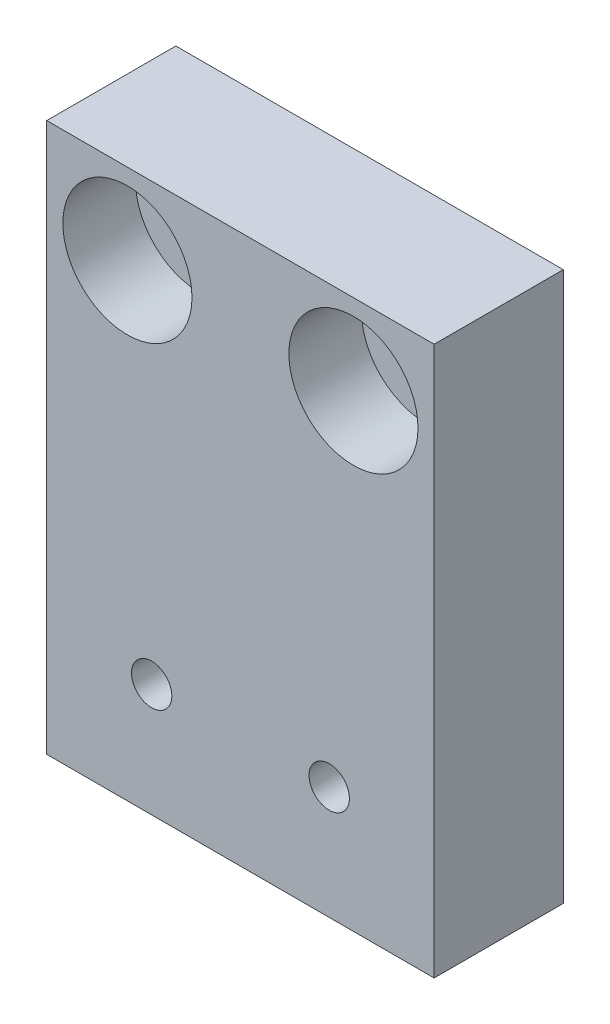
ISO-10303-21;
HEADER;
FILE_DESCRIPTION(('STEP AP214'),'2;1');
FILE_NAME('part.step','',(''),(''),'','','');
FILE_SCHEMA(('AUTOMOTIVE_DESIGN { 1 0 10303 214 1 1 1 1 }'));
ENDSEC;
DATA;
#1=APPLICATION_CONTEXT('core data for automotive mechanical design processes');
#2=APPLICATION_PROTOCOL_DEFINITION('international standard','automotive_design',2000,#1);
#3=PRODUCT_CONTEXT('',#1,'mechanical');
#4=PRODUCT('Part','Part','',(#3));
#5=PRODUCT_RELATED_PRODUCT_CATEGORY('part','',(#4));
#6=PRODUCT_DEFINITION_FORMATION('','',#4);
#7=PRODUCT_DEFINITION_CONTEXT('part definition',#1,'design');
#8=PRODUCT_DEFINITION('design','',#6,#7);
#9=PRODUCT_DEFINITION_SHAPE('','',#8);
#10=(LENGTH_UNIT() NAMED_UNIT(*) SI_UNIT(.MILLI.,.METRE.));
#11=(NAMED_UNIT(*) PLANE_ANGLE_UNIT() SI_UNIT($,.RADIAN.));
#12=(NAMED_UNIT(*) SI_UNIT($,.STERADIAN.) SOLID_ANGLE_UNIT());
#13=UNCERTAINTY_MEASURE_WITH_UNIT(LENGTH_MEASURE(1.E-05),#10,'distance_accuracy_value','');
#14=(GEOMETRIC_REPRESENTATION_CONTEXT(3) GLOBAL_UNCERTAINTY_ASSIGNED_CONTEXT((#13)) GLOBAL_UNIT_ASSIGNED_CONTEXT((#10,
#11,#12)) REPRESENTATION_CONTEXT('',''));
#15=CARTESIAN_POINT('',(0.,0.,0.));
#16=DIRECTION('',(0.,0.,1.));
#17=DIRECTION('',(1.,0.,0.));
#18=AXIS2_PLACEMENT_3D('',#15,#16,#17);
#19=CARTESIAN_POINT('',(19.,29.,-4.5));
#20=DIRECTION('',(0.,0.,1.));
#21=DIRECTION('',(1.,0.,0.));
#22=AXIS2_PLACEMENT_3D('',#19,#20,#21);
#23=CYLINDRICAL_SURFACE('',#22,4.);
#24=CARTESIAN_POINT('',(19.,29.,-4.5));
#25=DIRECTION('',(0.,0.,1.));
#26=DIRECTION('',(1.,0.,0.));
#27=AXIS2_PLACEMENT_3D('',#24,#25,#26);
#28=CIRCLE('',#27,4.);
#29=CARTESIAN_POINT('',(23.,29.,-4.5));
#30=VERTEX_POINT('',#29);
#31=EDGE_CURVE('E20',#30,#30,#28,.T.);
#32=ORIENTED_EDGE('',*,*,#31,.F.);
#33=EDGE_LOOP('',(#32));
#34=FACE_BOUND('',#33,.T.);
#35=CARTESIAN_POINT('',(19.,29.,0.));
#36=DIRECTION('',(0.,0.,1.));
#37=DIRECTION('',(1.,0.,0.));
#38=AXIS2_PLACEMENT_3D('',#35,#36,#37);
#39=CIRCLE('',#38,4.);
#40=CARTESIAN_POINT('',(23.,29.,0.));
#41=VERTEX_POINT('',#40);
#42=EDGE_CURVE('E108',#41,#41,#39,.T.);
#43=ORIENTED_EDGE('',*,*,#42,.T.);
#44=EDGE_LOOP('',(#43));
#45=FACE_BOUND('',#44,.T.);
#46=ADVANCED_FACE('F17',(#34,#45),#23,.F.);
#47=CARTESIAN_POINT('',(5.,29.,-4.5));
#48=DIRECTION('',(0.,0.,1.));
#49=DIRECTION('',(1.,0.,0.));
#50=AXIS2_PLACEMENT_3D('',#47,#48,#49);
#51=CYLINDRICAL_SURFACE('',#50,4.);
#52=CARTESIAN_POINT('',(5.,29.,-4.5));
#53=DIRECTION('',(0.,0.,1.));
#54=DIRECTION('',(1.,0.,0.));
#55=AXIS2_PLACEMENT_3D('',#52,#53,#54);
#56=CIRCLE('',#55,4.);
#57=CARTESIAN_POINT('',(9.,29.,-4.5));
#58=VERTEX_POINT('',#57);
#59=EDGE_CURVE('E110',#58,#58,#56,.T.);
#60=ORIENTED_EDGE('',*,*,#59,.F.);
#61=EDGE_LOOP('',(#60));
#62=FACE_BOUND('',#61,.T.);
#63=CARTESIAN_POINT('',(5.,29.,0.));
#64=DIRECTION('',(0.,0.,1.));
#65=DIRECTION('',(1.,0.,0.));
#66=AXIS2_PLACEMENT_3D('',#63,#64,#65);
#67=CIRCLE('',#66,4.);
#68=CARTESIAN_POINT('',(9.,29.,0.));
#69=VERTEX_POINT('',#68);
#70=EDGE_CURVE('E105',#69,#69,#67,.T.);
#71=ORIENTED_EDGE('',*,*,#70,.T.);
#72=EDGE_LOOP('',(#71));
#73=FACE_BOUND('',#72,.T.);
#74=ADVANCED_FACE('F121',(#62,#73),#51,.F.);
#75=CARTESIAN_POINT('',(19.,29.,-4.5));
#76=DIRECTION('',(0.,0.,1.));
#77=DIRECTION('',(1.,0.,0.));
#78=AXIS2_PLACEMENT_3D('',#75,#76,#77);
#79=PLANE('',#78);
#80=CARTESIAN_POINT('',(19.,29.,-4.5));
#81=DIRECTION('',(0.,0.,1.));
#82=DIRECTION('',(1.,0.,0.));
#83=AXIS2_PLACEMENT_3D('',#80,#81,#82);
#84=CIRCLE('',#83,2.25);
#85=CARTESIAN_POINT('',(21.25,29.,-4.5));
#86=VERTEX_POINT('',#85);
#87=EDGE_CURVE('E96',#86,#86,#84,.F.);
#88=ORIENTED_EDGE('',*,*,#87,.T.);
#89=EDGE_LOOP('',(#88));
#90=FACE_BOUND('',#89,.T.);
#91=ORIENTED_EDGE('',*,*,#31,.T.);
#92=EDGE_LOOP('',(#91));
#93=FACE_BOUND('',#92,.T.);
#94=ADVANCED_FACE('F117',(#90,#93),#79,.T.);
#95=CARTESIAN_POINT('',(5.,29.,-4.5));
#96=DIRECTION('',(0.,0.,1.));
#97=DIRECTION('',(1.,0.,0.));
#98=AXIS2_PLACEMENT_3D('',#95,#96,#97);
#99=PLANE('',#98);
#100=CARTESIAN_POINT('',(5.,29.,-4.5));
#101=DIRECTION('',(0.,0.,1.));
#102=DIRECTION('',(1.,0.,0.));
#103=AXIS2_PLACEMENT_3D('',#100,#101,#102);
#104=CIRCLE('',#103,2.25);
#105=CARTESIAN_POINT('',(7.25,29.,-4.5));
#106=VERTEX_POINT('',#105);
#107=EDGE_CURVE('E67',#106,#106,#104,.F.);
#108=ORIENTED_EDGE('',*,*,#107,.T.);
#109=EDGE_LOOP('',(#108));
#110=FACE_BOUND('',#109,.T.);
#111=ORIENTED_EDGE('',*,*,#59,.T.);
#112=EDGE_LOOP('',(#111));
#113=FACE_BOUND('',#112,.T.);
#114=ADVANCED_FACE('F127',(#110,#113),#99,.T.);
#115=CARTESIAN_POINT('',(0.,34.,0.));
#116=DIRECTION('',(0.,0.,-1.));
#117=DIRECTION('',(-1.,0.,0.));
#118=AXIS2_PLACEMENT_3D('',#115,#116,#117);
#119=PLANE('',#118);
#120=DIRECTION('',(0.,1.,0.));
#121=VECTOR('',#120,1.);
#122=CARTESIAN_POINT('',(24.,34.,0.));
#123=LINE('',#122,#121);
#124=CARTESIAN_POINT('',(24.,0.,0.));
#125=VERTEX_POINT('',#124);
#126=CARTESIAN_POINT('',(24.,34.,0.));
#127=VERTEX_POINT('',#126);
#128=EDGE_CURVE('E58',#125,#127,#123,.T.);
#129=ORIENTED_EDGE('',*,*,#128,.T.);
#130=DIRECTION('',(1.,0.,0.));
#131=VECTOR('',#130,1.);
#132=CARTESIAN_POINT('',(0.,34.,0.));
#133=LINE('',#132,#131);
#134=CARTESIAN_POINT('',(0.,34.,0.));
#135=VERTEX_POINT('',#134);
#136=EDGE_CURVE('E55',#127,#135,#133,.F.);
#137=ORIENTED_EDGE('',*,*,#136,.T.);
#138=DIRECTION('',(0.,1.,0.));
#139=VECTOR('',#138,1.);
#140=CARTESIAN_POINT('',(0.,34.,0.));
#141=LINE('',#140,#139);
#142=CARTESIAN_POINT('',(0.,0.,0.));
#143=VERTEX_POINT('',#142);
#144=EDGE_CURVE('E310',#135,#143,#141,.F.);
#145=ORIENTED_EDGE('',*,*,#144,.T.);
#146=DIRECTION('',(1.,0.,0.));
#147=VECTOR('',#146,1.);
#148=CARTESIAN_POINT('',(0.,0.,0.));
#149=LINE('',#148,#147);
#150=EDGE_CURVE('E61',#125,#143,#149,.F.);
#151=ORIENTED_EDGE('',*,*,#150,.F.);
#152=EDGE_LOOP('',(#129,#137,#145,#151));
#153=FACE_BOUND('',#152,.T.);
#154=ORIENTED_EDGE('',*,*,#70,.F.);
#155=EDGE_LOOP('',(#154));
#156=FACE_BOUND('',#155,.T.);
#157=ORIENTED_EDGE('',*,*,#42,.F.);
#158=EDGE_LOOP('',(#157));
#159=FACE_BOUND('',#158,.T.);
#160=CARTESIAN_POINT('',(17.5,7.,0.));
#161=DIRECTION('',(0.,0.,1.));
#162=DIRECTION('',(1.,0.,0.));
#163=AXIS2_PLACEMENT_3D('',#160,#161,#162);
#164=CIRCLE('',#163,1.24999999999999);
#165=CARTESIAN_POINT('',(18.75,7.,0.));
#166=VERTEX_POINT('',#165);
#167=EDGE_CURVE('E99',#166,#166,#164,.F.);
#168=ORIENTED_EDGE('',*,*,#167,.T.);
#169=EDGE_LOOP('',(#168));
#170=FACE_BOUND('',#169,.T.);
#171=CARTESIAN_POINT('',(6.5,7.,0.));
#172=DIRECTION('',(0.,0.,1.));
#173=DIRECTION('',(1.,0.,0.));
#174=AXIS2_PLACEMENT_3D('',#171,#172,#173);
#175=CIRCLE('',#174,1.24999999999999);
#176=CARTESIAN_POINT('',(7.74999999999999,7.,0.));
#177=VERTEX_POINT('',#176);
#178=EDGE_CURVE('E102',#177,#177,#175,.F.);
#179=ORIENTED_EDGE('',*,*,#178,.T.);
#180=EDGE_LOOP('',(#179));
#181=FACE_BOUND('',#180,.T.);
#182=ADVANCED_FACE('F59',(#153,#156,#159,#170,#181),#119,.F.);
#183=CARTESIAN_POINT('',(6.5,7.,0.));
#184=DIRECTION('',(0.,0.,1.));
#185=DIRECTION('',(1.,0.,0.));
#186=AXIS2_PLACEMENT_3D('',#183,#184,#185);
#187=CYLINDRICAL_SURFACE('',#186,1.24999999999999);
#188=CARTESIAN_POINT('',(6.5,7.,-8.));
#189=DIRECTION('',(0.,0.,1.));
#190=DIRECTION('',(1.,0.,0.));
#191=AXIS2_PLACEMENT_3D('',#188,#189,#190);
#192=CIRCLE('',#191,1.24999999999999);
#193=CARTESIAN_POINT('',(7.74999999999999,7.,-8.));
#194=VERTEX_POINT('',#193);
#195=EDGE_CURVE('E91',#194,#194,#192,.F.);
#196=ORIENTED_EDGE('',*,*,#195,.T.);
#197=EDGE_LOOP('',(#196));
#198=FACE_BOUND('',#197,.T.);
#199=ORIENTED_EDGE('',*,*,#178,.F.);
#200=EDGE_LOOP('',(#199));
#201=FACE_BOUND('',#200,.T.);
#202=ADVANCED_FACE('F126',(#198,#201),#187,.F.);
#203=CARTESIAN_POINT('',(17.5,7.,0.));
#204=DIRECTION('',(0.,0.,1.));
#205=DIRECTION('',(1.,0.,0.));
#206=AXIS2_PLACEMENT_3D('',#203,#204,#205);
#207=CYLINDRICAL_SURFACE('',#206,1.24999999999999);
#208=CARTESIAN_POINT('',(17.5,7.,-8.));
#209=DIRECTION('',(0.,0.,1.));
#210=DIRECTION('',(1.,0.,0.));
#211=AXIS2_PLACEMENT_3D('',#208,#209,#210);
#212=CIRCLE('',#211,1.24999999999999);
#213=CARTESIAN_POINT('',(18.75,7.,-8.));
#214=VERTEX_POINT('',#213);
#215=EDGE_CURVE('E88',#214,#214,#212,.F.);
#216=ORIENTED_EDGE('',*,*,#215,.T.);
#217=EDGE_LOOP('',(#216));
#218=FACE_BOUND('',#217,.T.);
#219=ORIENTED_EDGE('',*,*,#167,.F.);
#220=EDGE_LOOP('',(#219));
#221=FACE_BOUND('',#220,.T.);
#222=ADVANCED_FACE('F134',(#218,#221),#207,.F.);
#223=CARTESIAN_POINT('',(19.,29.,-8.));
#224=DIRECTION('',(0.,0.,1.));
#225=DIRECTION('',(1.,0.,0.));
#226=AXIS2_PLACEMENT_3D('',#223,#224,#225);
#227=CYLINDRICAL_SURFACE('',#226,2.25);
#228=CARTESIAN_POINT('',(19.,29.,-8.));
#229=DIRECTION('',(0.,0.,1.));
#230=DIRECTION('',(1.,0.,0.));
#231=AXIS2_PLACEMENT_3D('',#228,#229,#230);
#232=CIRCLE('',#231,2.25);
#233=CARTESIAN_POINT('',(21.25,29.,-8.));
#234=VERTEX_POINT('',#233);
#235=EDGE_CURVE('E85',#234,#234,#232,.F.);
#236=ORIENTED_EDGE('',*,*,#235,.T.);
#237=EDGE_LOOP('',(#236));
#238=FACE_BOUND('',#237,.T.);
#239=ORIENTED_EDGE('',*,*,#87,.F.);
#240=EDGE_LOOP('',(#239));
#241=FACE_BOUND('',#240,.T.);
#242=ADVANCED_FACE('F141',(#238,#241),#227,.F.);
#243=CARTESIAN_POINT('',(5.,29.,-8.));
#244=DIRECTION('',(0.,0.,1.));
#245=DIRECTION('',(1.,0.,0.));
#246=AXIS2_PLACEMENT_3D('',#243,#244,#245);
#247=CYLINDRICAL_SURFACE('',#246,2.25);
#248=CARTESIAN_POINT('',(5.,29.,-8.));
#249=DIRECTION('',(0.,0.,1.));
#250=DIRECTION('',(1.,0.,0.));
#251=AXIS2_PLACEMENT_3D('',#248,#249,#250);
#252=CIRCLE('',#251,2.25);
#253=CARTESIAN_POINT('',(7.25,29.,-8.));
#254=VERTEX_POINT('',#253);
#255=EDGE_CURVE('E82',#254,#254,#252,.F.);
#256=ORIENTED_EDGE('',*,*,#255,.T.);
#257=EDGE_LOOP('',(#256));
#258=FACE_BOUND('',#257,.T.);
#259=ORIENTED_EDGE('',*,*,#107,.F.);
#260=EDGE_LOOP('',(#259));
#261=FACE_BOUND('',#260,.T.);
#262=ADVANCED_FACE('F164',(#258,#261),#247,.F.);
#263=CARTESIAN_POINT('',(24.,34.,0.));
#264=DIRECTION('',(-1.,0.,0.));
#265=DIRECTION('',(0.,0.,1.));
#266=AXIS2_PLACEMENT_3D('',#263,#264,#265);
#267=PLANE('',#266);
#268=DIRECTION('',(0.,1.,0.));
#269=VECTOR('',#268,1.);
#270=CARTESIAN_POINT('',(24.,34.,-8.));
#271=LINE('',#270,#269);
#272=CARTESIAN_POINT('',(24.,0.,-8.));
#273=VERTEX_POINT('',#272);
#274=CARTESIAN_POINT('',(24.,34.,-8.));
#275=VERTEX_POINT('',#274);
#276=EDGE_CURVE('E78',#273,#275,#271,.T.);
#277=ORIENTED_EDGE('',*,*,#276,.T.);
#278=DIRECTION('',(0.,0.,-1.));
#279=VECTOR('',#278,1.);
#280=CARTESIAN_POINT('',(24.,34.,0.));
#281=LINE('',#280,#279);
#282=EDGE_CURVE('E66',#275,#127,#281,.F.);
#283=ORIENTED_EDGE('',*,*,#282,.T.);
#284=ORIENTED_EDGE('',*,*,#128,.F.);
#285=DIRECTION('',(0.,0.,-1.));
#286=VECTOR('',#285,1.);
#287=CARTESIAN_POINT('',(24.,0.,0.));
#288=LINE('',#287,#286);
#289=EDGE_CURVE('E313',#273,#125,#288,.F.);
#290=ORIENTED_EDGE('',*,*,#289,.F.);
#291=EDGE_LOOP('',(#277,#283,#284,#290));
#292=FACE_BOUND('',#291,.T.);
#293=ADVANCED_FACE('F77',(#292),#267,.F.);
#294=CARTESIAN_POINT('',(0.,34.,0.));
#295=DIRECTION('',(0.,-1.,0.));
#296=DIRECTION('',(0.,0.,-1.));
#297=AXIS2_PLACEMENT_3D('',#294,#295,#296);
#298=PLANE('',#297);
#299=ORIENTED_EDGE('',*,*,#136,.F.);
#300=ORIENTED_EDGE('',*,*,#282,.F.);
#301=DIRECTION('',(1.,0.,0.));
#302=VECTOR('',#301,1.);
#303=CARTESIAN_POINT('',(0.,34.,-8.));
#304=LINE('',#303,#302);
#305=CARTESIAN_POINT('',(0.,34.,-8.));
#306=VERTEX_POINT('',#305);
#307=EDGE_CURVE('E319',#275,#306,#304,.F.);
#308=ORIENTED_EDGE('',*,*,#307,.T.);
#309=DIRECTION('',(0.,0.,-1.));
#310=VECTOR('',#309,1.);
#311=CARTESIAN_POINT('',(0.,34.,0.));
#312=LINE('',#311,#310);
#313=EDGE_CURVE('E74',#306,#135,#312,.F.);
#314=ORIENTED_EDGE('',*,*,#313,.T.);
#315=EDGE_LOOP('',(#299,#300,#308,#314));
#316=FACE_BOUND('',#315,.T.);
#317=ADVANCED_FACE('F71',(#316),#298,.F.);
#318=CARTESIAN_POINT('',(0.,34.,0.));
#319=DIRECTION('',(1.,0.,0.));
#320=DIRECTION('',(0.,0.,-1.));
#321=AXIS2_PLACEMENT_3D('',#318,#319,#320);
#322=PLANE('',#321);
#323=ORIENTED_EDGE('',*,*,#144,.F.);
#324=ORIENTED_EDGE('',*,*,#313,.F.);
#325=DIRECTION('',(0.,1.,0.));
#326=VECTOR('',#325,1.);
#327=CARTESIAN_POINT('',(0.,34.,-8.));
#328=LINE('',#327,#326);
#329=CARTESIAN_POINT('',(0.,0.,-8.));
#330=VERTEX_POINT('',#329);
#331=EDGE_CURVE('E26',#306,#330,#328,.F.);
#332=ORIENTED_EDGE('',*,*,#331,.T.);
#333=DIRECTION('',(0.,0.,-1.));
#334=VECTOR('',#333,1.);
#335=CARTESIAN_POINT('',(0.,0.,0.));
#336=LINE('',#335,#334);
#337=EDGE_CURVE('E34',#143,#330,#336,.T.);
#338=ORIENTED_EDGE('',*,*,#337,.F.);
#339=EDGE_LOOP('',(#323,#324,#332,#338));
#340=FACE_BOUND('',#339,.T.);
#341=ADVANCED_FACE('F152',(#340),#322,.F.);
#342=CARTESIAN_POINT('',(0.,0.,0.));
#343=DIRECTION('',(0.,-1.,0.));
#344=DIRECTION('',(0.,0.,-1.));
#345=AXIS2_PLACEMENT_3D('',#342,#343,#344);
#346=PLANE('',#345);
#347=ORIENTED_EDGE('',*,*,#289,.T.);
#348=ORIENTED_EDGE('',*,*,#150,.T.);
#349=ORIENTED_EDGE('',*,*,#337,.T.);
#350=DIRECTION('',(1.,0.,0.));
#351=VECTOR('',#350,1.);
#352=CARTESIAN_POINT('',(0.,0.,-8.));
#353=LINE('',#352,#351);
#354=EDGE_CURVE('E11',#330,#273,#353,.T.);
#355=ORIENTED_EDGE('',*,*,#354,.T.);
#356=EDGE_LOOP('',(#347,#348,#349,#355));
#357=FACE_BOUND('',#356,.T.);
#358=ADVANCED_FACE('F146',(#357),#346,.T.);
#359=CARTESIAN_POINT('',(0.,34.,-8.));
#360=DIRECTION('',(0.,0.,1.));
#361=DIRECTION('',(1.,0.,0.));
#362=AXIS2_PLACEMENT_3D('',#359,#360,#361);
#363=PLANE('',#362);
#364=ORIENTED_EDGE('',*,*,#331,.F.);
#365=ORIENTED_EDGE('',*,*,#307,.F.);
#366=ORIENTED_EDGE('',*,*,#276,.F.);
#367=ORIENTED_EDGE('',*,*,#354,.F.);
#368=EDGE_LOOP('',(#364,#365,#366,#367));
#369=FACE_BOUND('',#368,.T.);
#370=ORIENTED_EDGE('',*,*,#255,.F.);
#371=EDGE_LOOP('',(#370));
#372=FACE_BOUND('',#371,.T.);
#373=ORIENTED_EDGE('',*,*,#235,.F.);
#374=EDGE_LOOP('',(#373));
#375=FACE_BOUND('',#374,.T.);
#376=ORIENTED_EDGE('',*,*,#215,.F.);
#377=EDGE_LOOP('',(#376));
#378=FACE_BOUND('',#377,.T.);
#379=ORIENTED_EDGE('',*,*,#195,.F.);
#380=EDGE_LOOP('',(#379));
#381=FACE_BOUND('',#380,.T.);
#382=ADVANCED_FACE('F144',(#369,#372,#375,#378,#381),#363,.F.);
#383=CLOSED_SHELL('',(#46,#74,#94,#114,#182,#202,#222,#242,#262,#293,#317,#341,#358,#382));
#384=MANIFOLD_SOLID_BREP('B1',#383);
#385=ADVANCED_BREP_SHAPE_REPRESENTATION('',(#18,#384),#14);
#386=SHAPE_DEFINITION_REPRESENTATION(#9,#385);
ENDSEC;
END-ISO-10303-21;
